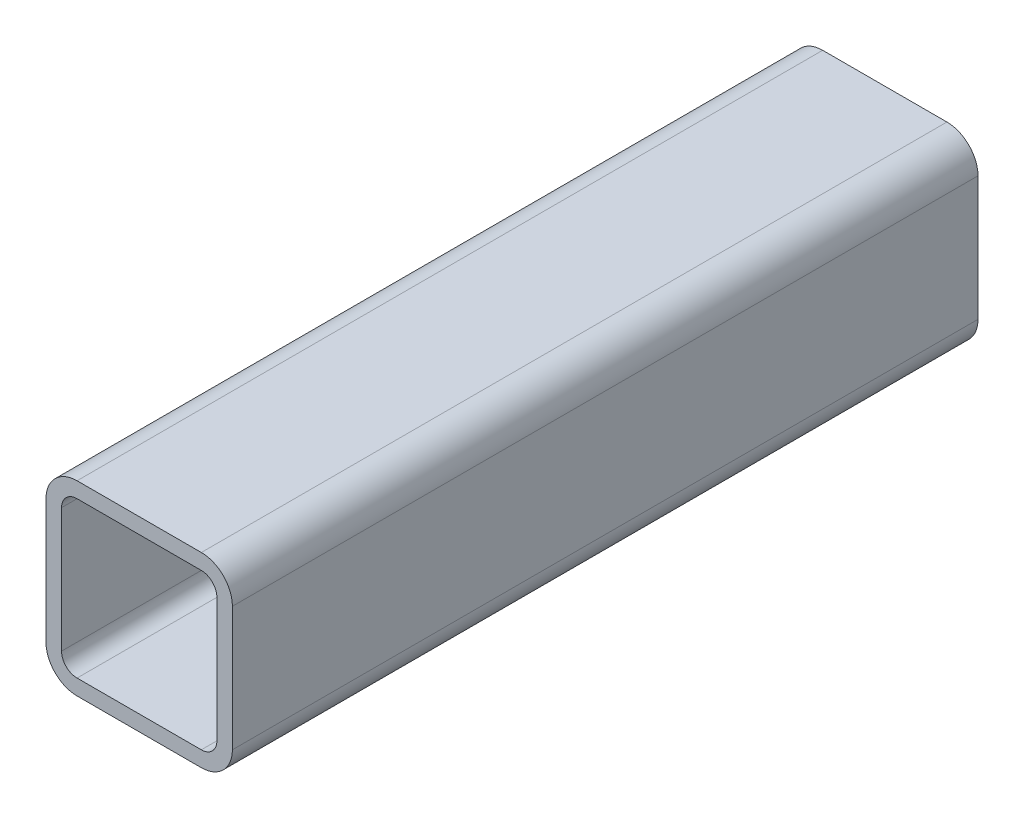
ISO-10303-21;
HEADER;
FILE_DESCRIPTION(('STEP AP214'),'2;1');
FILE_NAME('part.step','',(''),(''),'','','');
FILE_SCHEMA(('AUTOMOTIVE_DESIGN { 1 0 10303 214 1 1 1 1 }'));
ENDSEC;
DATA;
#1=APPLICATION_CONTEXT('core data for automotive mechanical design processes');
#2=APPLICATION_PROTOCOL_DEFINITION('international standard','automotive_design',2000,#1);
#3=PRODUCT_CONTEXT('',#1,'mechanical');
#4=PRODUCT('Part','Part','',(#3));
#5=PRODUCT_RELATED_PRODUCT_CATEGORY('part','',(#4));
#6=PRODUCT_DEFINITION_FORMATION('','',#4);
#7=PRODUCT_DEFINITION_CONTEXT('part definition',#1,'design');
#8=PRODUCT_DEFINITION('design','',#6,#7);
#9=PRODUCT_DEFINITION_SHAPE('','',#8);
#10=(LENGTH_UNIT() NAMED_UNIT(*) SI_UNIT(.MILLI.,.METRE.));
#11=(NAMED_UNIT(*) PLANE_ANGLE_UNIT() SI_UNIT($,.RADIAN.));
#12=(NAMED_UNIT(*) SI_UNIT($,.STERADIAN.) SOLID_ANGLE_UNIT());
#13=UNCERTAINTY_MEASURE_WITH_UNIT(LENGTH_MEASURE(1.E-05),#10,'distance_accuracy_value','');
#14=(GEOMETRIC_REPRESENTATION_CONTEXT(3) GLOBAL_UNCERTAINTY_ASSIGNED_CONTEXT((#13)) GLOBAL_UNIT_ASSIGNED_CONTEXT((#10,
#11,#12)) REPRESENTATION_CONTEXT('',''));
#15=CARTESIAN_POINT('',(0.,0.,0.));
#16=DIRECTION('',(0.,0.,1.));
#17=DIRECTION('',(1.,0.,0.));
#18=AXIS2_PLACEMENT_3D('',#15,#16,#17);
#19=CARTESIAN_POINT('',(15.1891160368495,65.5806737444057,304.8));
#20=DIRECTION('',(0.,0.,1.));
#21=DIRECTION('',(1.,0.,0.));
#22=AXIS2_PLACEMENT_3D('',#19,#20,#21);
#23=PLANE('',#22);
#24=CARTESIAN_POINT('',(15.1891160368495,65.5806737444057,304.8));
#25=DIRECTION('',(0.,0.,1.));
#26=DIRECTION('',(1.,0.,0.));
#27=AXIS2_PLACEMENT_3D('',#24,#25,#26);
#28=CIRCLE('',#27,12.7);
#29=CARTESIAN_POINT('',(15.1891160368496,78.2806737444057,304.8));
#30=VERTEX_POINT('',#29);
#31=CARTESIAN_POINT('',(2.48911603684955,65.5806737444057,304.8));
#32=VERTEX_POINT('',#31);
#33=EDGE_CURVE('E211',#30,#32,#28,.T.);
#34=ORIENTED_EDGE('',*,*,#33,.T.);
#35=DIRECTION('',(0.,-1.,0.));
#36=VECTOR('',#35,1.);
#37=CARTESIAN_POINT('',(2.48911603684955,14.7806737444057,304.8));
#38=LINE('',#37,#36);
#39=CARTESIAN_POINT('',(2.48911603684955,14.7806737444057,304.8));
#40=VERTEX_POINT('',#39);
#41=EDGE_CURVE('E214',#32,#40,#38,.T.);
#42=ORIENTED_EDGE('',*,*,#41,.T.);
#43=CARTESIAN_POINT('',(15.1891160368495,14.7806737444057,304.8));
#44=DIRECTION('',(0.,0.,1.));
#45=DIRECTION('',(1.,0.,0.));
#46=AXIS2_PLACEMENT_3D('',#43,#44,#45);
#47=CIRCLE('',#46,12.7);
#48=CARTESIAN_POINT('',(15.1891160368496,2.0806737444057,304.8));
#49=VERTEX_POINT('',#48);
#50=EDGE_CURVE('E217',#40,#49,#47,.T.);
#51=ORIENTED_EDGE('',*,*,#50,.T.);
#52=DIRECTION('',(1.,0.,0.));
#53=VECTOR('',#52,1.);
#54=CARTESIAN_POINT('',(65.9891160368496,2.0806737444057,304.8));
#55=LINE('',#54,#53);
#56=CARTESIAN_POINT('',(65.9891160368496,2.08067374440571,304.8));
#57=VERTEX_POINT('',#56);
#58=EDGE_CURVE('E219',#49,#57,#55,.T.);
#59=ORIENTED_EDGE('',*,*,#58,.T.);
#60=CARTESIAN_POINT('',(65.9891160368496,14.7806737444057,304.8));
#61=DIRECTION('',(0.,0.,1.));
#62=DIRECTION('',(1.,0.,0.));
#63=AXIS2_PLACEMENT_3D('',#60,#61,#62);
#64=CIRCLE('',#63,12.7);
#65=CARTESIAN_POINT('',(78.6891160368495,14.7806737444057,304.8));
#66=VERTEX_POINT('',#65);
#67=EDGE_CURVE('E221',#57,#66,#64,.T.);
#68=ORIENTED_EDGE('',*,*,#67,.T.);
#69=DIRECTION('',(0.,1.,0.));
#70=VECTOR('',#69,1.);
#71=CARTESIAN_POINT('',(78.6891160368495,65.5806737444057,304.8));
#72=LINE('',#71,#70);
#73=CARTESIAN_POINT('',(78.6891160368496,65.5806737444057,304.8));
#74=VERTEX_POINT('',#73);
#75=EDGE_CURVE('E223',#66,#74,#72,.T.);
#76=ORIENTED_EDGE('',*,*,#75,.T.);
#77=CARTESIAN_POINT('',(65.9891160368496,65.5806737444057,304.8));
#78=DIRECTION('',(0.,0.,1.));
#79=DIRECTION('',(1.,0.,0.));
#80=AXIS2_PLACEMENT_3D('',#77,#78,#79);
#81=CIRCLE('',#80,12.7);
#82=CARTESIAN_POINT('',(65.9891160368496,78.2806737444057,304.8));
#83=VERTEX_POINT('',#82);
#84=EDGE_CURVE('E225',#74,#83,#81,.T.);
#85=ORIENTED_EDGE('',*,*,#84,.T.);
#86=DIRECTION('',(-1.,0.,0.));
#87=VECTOR('',#86,1.);
#88=CARTESIAN_POINT('',(15.1891160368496,78.2806737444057,304.8));
#89=LINE('',#88,#87);
#90=EDGE_CURVE('E227',#83,#30,#89,.T.);
#91=ORIENTED_EDGE('',*,*,#90,.T.);
#92=EDGE_LOOP('',(#34,#42,#51,#59,#68,#76,#85,#91));
#93=FACE_BOUND('',#92,.T.);
#94=DIRECTION('',(0.,-1.,0.));
#95=VECTOR('',#94,1.);
#96=CARTESIAN_POINT('',(8.83911603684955,14.7806737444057,304.8));
#97=LINE('',#96,#95);
#98=CARTESIAN_POINT('',(8.83911603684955,65.5806737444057,304.8));
#99=VERTEX_POINT('',#98);
#100=CARTESIAN_POINT('',(8.83911603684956,14.7806737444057,304.8));
#101=VERTEX_POINT('',#100);
#102=EDGE_CURVE('E154',#99,#101,#97,.T.);
#103=ORIENTED_EDGE('',*,*,#102,.F.);
#104=CARTESIAN_POINT('',(15.1891160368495,65.5806737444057,304.8));
#105=DIRECTION('',(0.,0.,1.));
#106=DIRECTION('',(1.,0.,0.));
#107=AXIS2_PLACEMENT_3D('',#104,#105,#106);
#108=CIRCLE('',#107,6.35);
#109=CARTESIAN_POINT('',(15.1891160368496,71.9306737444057,304.8));
#110=VERTEX_POINT('',#109);
#111=EDGE_CURVE('E146',#110,#99,#108,.T.);
#112=ORIENTED_EDGE('',*,*,#111,.F.);
#113=DIRECTION('',(-1.,0.,0.));
#114=VECTOR('',#113,1.);
#115=CARTESIAN_POINT('',(15.1891160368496,71.9306737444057,304.8));
#116=LINE('',#115,#114);
#117=CARTESIAN_POINT('',(65.9891160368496,71.9306737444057,304.8));
#118=VERTEX_POINT('',#117);
#119=EDGE_CURVE('E179',#118,#110,#116,.T.);
#120=ORIENTED_EDGE('',*,*,#119,.F.);
#121=CARTESIAN_POINT('',(65.9891160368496,65.5806737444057,304.8));
#122=DIRECTION('',(0.,0.,1.));
#123=DIRECTION('',(1.,0.,0.));
#124=AXIS2_PLACEMENT_3D('',#121,#122,#123);
#125=CIRCLE('',#124,6.35);
#126=CARTESIAN_POINT('',(72.3391160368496,65.5806737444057,304.8));
#127=VERTEX_POINT('',#126);
#128=EDGE_CURVE('E177',#127,#118,#125,.T.);
#129=ORIENTED_EDGE('',*,*,#128,.F.);
#130=DIRECTION('',(0.,1.,0.));
#131=VECTOR('',#130,1.);
#132=CARTESIAN_POINT('',(72.3391160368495,65.5806737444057,304.8));
#133=LINE('',#132,#131);
#134=CARTESIAN_POINT('',(72.3391160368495,14.7806737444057,304.8));
#135=VERTEX_POINT('',#134);
#136=EDGE_CURVE('E175',#135,#127,#133,.T.);
#137=ORIENTED_EDGE('',*,*,#136,.F.);
#138=CARTESIAN_POINT('',(65.9891160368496,14.7806737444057,304.8));
#139=DIRECTION('',(0.,0.,1.));
#140=DIRECTION('',(1.,0.,0.));
#141=AXIS2_PLACEMENT_3D('',#138,#139,#140);
#142=CIRCLE('',#141,6.34999999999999);
#143=CARTESIAN_POINT('',(65.9891160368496,8.43067374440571,304.8));
#144=VERTEX_POINT('',#143);
#145=EDGE_CURVE('E173',#144,#135,#142,.T.);
#146=ORIENTED_EDGE('',*,*,#145,.F.);
#147=DIRECTION('',(1.,0.,0.));
#148=VECTOR('',#147,1.);
#149=CARTESIAN_POINT('',(65.9891160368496,8.4306737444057,304.8));
#150=LINE('',#149,#148);
#151=CARTESIAN_POINT('',(15.1891160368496,8.4306737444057,304.8));
#152=VERTEX_POINT('',#151);
#153=EDGE_CURVE('E169',#152,#144,#150,.T.);
#154=ORIENTED_EDGE('',*,*,#153,.F.);
#155=CARTESIAN_POINT('',(15.1891160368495,14.7806737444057,304.8));
#156=DIRECTION('',(0.,0.,1.));
#157=DIRECTION('',(1.,0.,0.));
#158=AXIS2_PLACEMENT_3D('',#155,#156,#157);
#159=CIRCLE('',#158,6.34999999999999);
#160=EDGE_CURVE('E167',#101,#152,#159,.T.);
#161=ORIENTED_EDGE('',*,*,#160,.F.);
#162=EDGE_LOOP('',(#103,#112,#120,#129,#137,#146,#154,#161));
#163=FACE_BOUND('',#162,.T.);
#164=ADVANCED_FACE('F33',(#93,#163),#23,.T.);
#165=CARTESIAN_POINT('',(15.1891160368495,65.5806737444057,0.));
#166=DIRECTION('',(0.,0.,1.));
#167=DIRECTION('',(1.,0.,0.));
#168=AXIS2_PLACEMENT_3D('',#165,#166,#167);
#169=PLANE('',#168);
#170=CARTESIAN_POINT('',(15.1891160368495,65.5806737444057,0.));
#171=DIRECTION('',(0.,0.,1.));
#172=DIRECTION('',(1.,0.,0.));
#173=AXIS2_PLACEMENT_3D('',#170,#171,#172);
#174=CIRCLE('',#173,12.7);
#175=CARTESIAN_POINT('',(15.1891160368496,78.2806737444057,0.));
#176=VERTEX_POINT('',#175);
#177=CARTESIAN_POINT('',(2.48911603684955,65.5806737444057,0.));
#178=VERTEX_POINT('',#177);
#179=EDGE_CURVE('E162',#176,#178,#174,.T.);
#180=ORIENTED_EDGE('',*,*,#179,.F.);
#181=DIRECTION('',(-1.,0.,0.));
#182=VECTOR('',#181,1.);
#183=CARTESIAN_POINT('',(15.1891160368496,78.2806737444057,0.));
#184=LINE('',#183,#182);
#185=CARTESIAN_POINT('',(65.9891160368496,78.2806737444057,0.));
#186=VERTEX_POINT('',#185);
#187=EDGE_CURVE('E215',#186,#176,#184,.T.);
#188=ORIENTED_EDGE('',*,*,#187,.F.);
#189=CARTESIAN_POINT('',(65.9891160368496,65.5806737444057,0.));
#190=DIRECTION('',(0.,0.,1.));
#191=DIRECTION('',(1.,0.,0.));
#192=AXIS2_PLACEMENT_3D('',#189,#190,#191);
#193=CIRCLE('',#192,12.7);
#194=CARTESIAN_POINT('',(78.6891160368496,65.5806737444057,0.));
#195=VERTEX_POINT('',#194);
#196=EDGE_CURVE('E242',#195,#186,#193,.T.);
#197=ORIENTED_EDGE('',*,*,#196,.F.);
#198=DIRECTION('',(0.,1.,0.));
#199=VECTOR('',#198,1.);
#200=CARTESIAN_POINT('',(78.6891160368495,65.5806737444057,0.));
#201=LINE('',#200,#199);
#202=CARTESIAN_POINT('',(78.6891160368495,14.7806737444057,0.));
#203=VERTEX_POINT('',#202);
#204=EDGE_CURVE('E240',#203,#195,#201,.T.);
#205=ORIENTED_EDGE('',*,*,#204,.F.);
#206=CARTESIAN_POINT('',(65.9891160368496,14.7806737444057,0.));
#207=DIRECTION('',(0.,0.,1.));
#208=DIRECTION('',(1.,0.,0.));
#209=AXIS2_PLACEMENT_3D('',#206,#207,#208);
#210=CIRCLE('',#209,12.7);
#211=CARTESIAN_POINT('',(65.9891160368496,2.08067374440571,0.));
#212=VERTEX_POINT('',#211);
#213=EDGE_CURVE('E238',#212,#203,#210,.T.);
#214=ORIENTED_EDGE('',*,*,#213,.F.);
#215=DIRECTION('',(1.,0.,0.));
#216=VECTOR('',#215,1.);
#217=CARTESIAN_POINT('',(65.9891160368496,2.0806737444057,0.));
#218=LINE('',#217,#216);
#219=CARTESIAN_POINT('',(15.1891160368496,2.0806737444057,0.));
#220=VERTEX_POINT('',#219);
#221=EDGE_CURVE('E236',#220,#212,#218,.T.);
#222=ORIENTED_EDGE('',*,*,#221,.F.);
#223=CARTESIAN_POINT('',(15.1891160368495,14.7806737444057,0.));
#224=DIRECTION('',(0.,0.,1.));
#225=DIRECTION('',(1.,0.,0.));
#226=AXIS2_PLACEMENT_3D('',#223,#224,#225);
#227=CIRCLE('',#226,12.7);
#228=CARTESIAN_POINT('',(2.48911603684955,14.7806737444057,0.));
#229=VERTEX_POINT('',#228);
#230=EDGE_CURVE('E234',#229,#220,#227,.T.);
#231=ORIENTED_EDGE('',*,*,#230,.F.);
#232=DIRECTION('',(0.,-1.,0.));
#233=VECTOR('',#232,1.);
#234=CARTESIAN_POINT('',(2.48911603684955,14.7806737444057,0.));
#235=LINE('',#234,#233);
#236=EDGE_CURVE('E232',#178,#229,#235,.T.);
#237=ORIENTED_EDGE('',*,*,#236,.F.);
#238=EDGE_LOOP('',(#180,#188,#197,#205,#214,#222,#231,#237));
#239=FACE_BOUND('',#238,.T.);
#240=CARTESIAN_POINT('',(15.1891160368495,65.5806737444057,0.));
#241=DIRECTION('',(0.,0.,1.));
#242=DIRECTION('',(1.,0.,0.));
#243=AXIS2_PLACEMENT_3D('',#240,#241,#242);
#244=CIRCLE('',#243,6.35);
#245=CARTESIAN_POINT('',(15.1891160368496,71.9306737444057,0.));
#246=VERTEX_POINT('',#245);
#247=CARTESIAN_POINT('',(8.83911603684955,65.5806737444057,0.));
#248=VERTEX_POINT('',#247);
#249=EDGE_CURVE('E56',#246,#248,#244,.T.);
#250=ORIENTED_EDGE('',*,*,#249,.T.);
#251=DIRECTION('',(0.,-1.,0.));
#252=VECTOR('',#251,1.);
#253=CARTESIAN_POINT('',(8.83911603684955,14.7806737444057,0.));
#254=LINE('',#253,#252);
#255=CARTESIAN_POINT('',(8.83911603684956,14.7806737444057,0.));
#256=VERTEX_POINT('',#255);
#257=EDGE_CURVE('E161',#248,#256,#254,.T.);
#258=ORIENTED_EDGE('',*,*,#257,.T.);
#259=CARTESIAN_POINT('',(15.1891160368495,14.7806737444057,0.));
#260=DIRECTION('',(0.,0.,1.));
#261=DIRECTION('',(1.,0.,0.));
#262=AXIS2_PLACEMENT_3D('',#259,#260,#261);
#263=CIRCLE('',#262,6.34999999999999);
#264=CARTESIAN_POINT('',(15.1891160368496,8.4306737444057,0.));
#265=VERTEX_POINT('',#264);
#266=EDGE_CURVE('E183',#256,#265,#263,.T.);
#267=ORIENTED_EDGE('',*,*,#266,.T.);
#268=DIRECTION('',(1.,0.,0.));
#269=VECTOR('',#268,1.);
#270=CARTESIAN_POINT('',(65.9891160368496,8.4306737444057,0.));
#271=LINE('',#270,#269);
#272=CARTESIAN_POINT('',(65.9891160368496,8.43067374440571,0.));
#273=VERTEX_POINT('',#272);
#274=EDGE_CURVE('E186',#265,#273,#271,.T.);
#275=ORIENTED_EDGE('',*,*,#274,.T.);
#276=CARTESIAN_POINT('',(65.9891160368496,14.7806737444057,0.));
#277=DIRECTION('',(0.,0.,1.));
#278=DIRECTION('',(1.,0.,0.));
#279=AXIS2_PLACEMENT_3D('',#276,#277,#278);
#280=CIRCLE('',#279,6.34999999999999);
#281=CARTESIAN_POINT('',(72.3391160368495,14.7806737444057,0.));
#282=VERTEX_POINT('',#281);
#283=EDGE_CURVE('E189',#273,#282,#280,.T.);
#284=ORIENTED_EDGE('',*,*,#283,.T.);
#285=DIRECTION('',(0.,1.,0.));
#286=VECTOR('',#285,1.);
#287=CARTESIAN_POINT('',(72.3391160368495,65.5806737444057,0.));
#288=LINE('',#287,#286);
#289=CARTESIAN_POINT('',(72.3391160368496,65.5806737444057,0.));
#290=VERTEX_POINT('',#289);
#291=EDGE_CURVE('E192',#282,#290,#288,.T.);
#292=ORIENTED_EDGE('',*,*,#291,.T.);
#293=CARTESIAN_POINT('',(65.9891160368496,65.5806737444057,0.));
#294=DIRECTION('',(0.,0.,1.));
#295=DIRECTION('',(1.,0.,0.));
#296=AXIS2_PLACEMENT_3D('',#293,#294,#295);
#297=CIRCLE('',#296,6.35);
#298=CARTESIAN_POINT('',(65.9891160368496,71.9306737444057,0.));
#299=VERTEX_POINT('',#298);
#300=EDGE_CURVE('E195',#290,#299,#297,.T.);
#301=ORIENTED_EDGE('',*,*,#300,.T.);
#302=DIRECTION('',(-1.,0.,0.));
#303=VECTOR('',#302,1.);
#304=CARTESIAN_POINT('',(15.1891160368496,71.9306737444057,0.));
#305=LINE('',#304,#303);
#306=EDGE_CURVE('E155',#299,#246,#305,.T.);
#307=ORIENTED_EDGE('',*,*,#306,.T.);
#308=EDGE_LOOP('',(#250,#258,#267,#275,#284,#292,#301,#307));
#309=FACE_BOUND('',#308,.T.);
#310=ADVANCED_FACE('F272',(#239,#309),#169,.F.);
#311=CARTESIAN_POINT('',(15.1891160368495,65.5806737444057,304.8));
#312=DIRECTION('',(0.,0.,-1.));
#313=DIRECTION('',(-1.,0.,0.));
#314=AXIS2_PLACEMENT_3D('',#311,#312,#313);
#315=CYLINDRICAL_SURFACE('',#314,12.7);
#316=ORIENTED_EDGE('',*,*,#179,.T.);
#317=DIRECTION('',(0.,0.,-1.));
#318=VECTOR('',#317,1.);
#319=CARTESIAN_POINT('',(2.48911603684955,65.5806737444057,304.8));
#320=LINE('',#319,#318);
#321=EDGE_CURVE('E11',#32,#178,#320,.T.);
#322=ORIENTED_EDGE('',*,*,#321,.F.);
#323=ORIENTED_EDGE('',*,*,#33,.F.);
#324=DIRECTION('',(0.,0.,-1.));
#325=VECTOR('',#324,1.);
#326=CARTESIAN_POINT('',(15.1891160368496,78.2806737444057,304.8));
#327=LINE('',#326,#325);
#328=EDGE_CURVE('E229',#30,#176,#327,.T.);
#329=ORIENTED_EDGE('',*,*,#328,.T.);
#330=EDGE_LOOP('',(#316,#322,#323,#329));
#331=FACE_BOUND('',#330,.T.);
#332=ADVANCED_FACE('F35',(#331),#315,.T.);
#333=CARTESIAN_POINT('',(2.48911603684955,14.7806737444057,304.8));
#334=DIRECTION('',(1.,0.,0.));
#335=DIRECTION('',(0.,0.,-1.));
#336=AXIS2_PLACEMENT_3D('',#333,#334,#335);
#337=PLANE('',#336);
#338=ORIENTED_EDGE('',*,*,#236,.T.);
#339=DIRECTION('',(0.,0.,-1.));
#340=VECTOR('',#339,1.);
#341=CARTESIAN_POINT('',(2.48911603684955,14.7806737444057,304.8));
#342=LINE('',#341,#340);
#343=EDGE_CURVE('E41',#40,#229,#342,.T.);
#344=ORIENTED_EDGE('',*,*,#343,.F.);
#345=ORIENTED_EDGE('',*,*,#41,.F.);
#346=ORIENTED_EDGE('',*,*,#321,.T.);
#347=EDGE_LOOP('',(#338,#344,#345,#346));
#348=FACE_BOUND('',#347,.T.);
#349=ADVANCED_FACE('F289',(#348),#337,.F.);
#350=CARTESIAN_POINT('',(15.1891160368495,14.7806737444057,304.8));
#351=DIRECTION('',(0.,0.,-1.));
#352=DIRECTION('',(-1.,0.,0.));
#353=AXIS2_PLACEMENT_3D('',#350,#351,#352);
#354=CYLINDRICAL_SURFACE('',#353,12.7);
#355=ORIENTED_EDGE('',*,*,#230,.T.);
#356=DIRECTION('',(0.,0.,-1.));
#357=VECTOR('',#356,1.);
#358=CARTESIAN_POINT('',(15.1891160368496,2.0806737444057,304.8));
#359=LINE('',#358,#357);
#360=EDGE_CURVE('E259',#49,#220,#359,.T.);
#361=ORIENTED_EDGE('',*,*,#360,.F.);
#362=ORIENTED_EDGE('',*,*,#50,.F.);
#363=ORIENTED_EDGE('',*,*,#343,.T.);
#364=EDGE_LOOP('',(#355,#361,#362,#363));
#365=FACE_BOUND('',#364,.T.);
#366=ADVANCED_FACE('F266',(#365),#354,.T.);
#367=CARTESIAN_POINT('',(65.9891160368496,2.0806737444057,304.8));
#368=DIRECTION('',(0.,1.,0.));
#369=DIRECTION('',(0.,0.,1.));
#370=AXIS2_PLACEMENT_3D('',#367,#368,#369);
#371=PLANE('',#370);
#372=ORIENTED_EDGE('',*,*,#221,.T.);
#373=DIRECTION('',(0.,0.,-1.));
#374=VECTOR('',#373,1.);
#375=CARTESIAN_POINT('',(65.9891160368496,2.08067374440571,304.8));
#376=LINE('',#375,#374);
#377=EDGE_CURVE('E256',#57,#212,#376,.T.);
#378=ORIENTED_EDGE('',*,*,#377,.F.);
#379=ORIENTED_EDGE('',*,*,#58,.F.);
#380=ORIENTED_EDGE('',*,*,#360,.T.);
#381=EDGE_LOOP('',(#372,#378,#379,#380));
#382=FACE_BOUND('',#381,.T.);
#383=ADVANCED_FACE('F278',(#382),#371,.F.);
#384=CARTESIAN_POINT('',(65.9891160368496,14.7806737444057,304.8));
#385=DIRECTION('',(0.,0.,-1.));
#386=DIRECTION('',(-1.,0.,0.));
#387=AXIS2_PLACEMENT_3D('',#384,#385,#386);
#388=CYLINDRICAL_SURFACE('',#387,12.7);
#389=ORIENTED_EDGE('',*,*,#213,.T.);
#390=DIRECTION('',(0.,0.,-1.));
#391=VECTOR('',#390,1.);
#392=CARTESIAN_POINT('',(78.6891160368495,14.7806737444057,304.8));
#393=LINE('',#392,#391);
#394=EDGE_CURVE('E253',#66,#203,#393,.T.);
#395=ORIENTED_EDGE('',*,*,#394,.F.);
#396=ORIENTED_EDGE('',*,*,#67,.F.);
#397=ORIENTED_EDGE('',*,*,#377,.T.);
#398=EDGE_LOOP('',(#389,#395,#396,#397));
#399=FACE_BOUND('',#398,.T.);
#400=ADVANCED_FACE('F282',(#399),#388,.T.);
#401=CARTESIAN_POINT('',(78.6891160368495,65.5806737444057,304.8));
#402=DIRECTION('',(-1.,0.,0.));
#403=DIRECTION('',(0.,0.,1.));
#404=AXIS2_PLACEMENT_3D('',#401,#402,#403);
#405=PLANE('',#404);
#406=ORIENTED_EDGE('',*,*,#204,.T.);
#407=DIRECTION('',(0.,0.,-1.));
#408=VECTOR('',#407,1.);
#409=CARTESIAN_POINT('',(78.6891160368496,65.5806737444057,304.8));
#410=LINE('',#409,#408);
#411=EDGE_CURVE('E250',#74,#195,#410,.T.);
#412=ORIENTED_EDGE('',*,*,#411,.F.);
#413=ORIENTED_EDGE('',*,*,#75,.F.);
#414=ORIENTED_EDGE('',*,*,#394,.T.);
#415=EDGE_LOOP('',(#406,#412,#413,#414));
#416=FACE_BOUND('',#415,.T.);
#417=ADVANCED_FACE('F302',(#416),#405,.F.);
#418=CARTESIAN_POINT('',(65.9891160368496,65.5806737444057,304.8));
#419=DIRECTION('',(0.,0.,-1.));
#420=DIRECTION('',(-1.,0.,0.));
#421=AXIS2_PLACEMENT_3D('',#418,#419,#420);
#422=CYLINDRICAL_SURFACE('',#421,12.7);
#423=ORIENTED_EDGE('',*,*,#196,.T.);
#424=DIRECTION('',(0.,0.,-1.));
#425=VECTOR('',#424,1.);
#426=CARTESIAN_POINT('',(65.9891160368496,78.2806737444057,304.8));
#427=LINE('',#426,#425);
#428=EDGE_CURVE('E247',#83,#186,#427,.T.);
#429=ORIENTED_EDGE('',*,*,#428,.F.);
#430=ORIENTED_EDGE('',*,*,#84,.F.);
#431=ORIENTED_EDGE('',*,*,#411,.T.);
#432=EDGE_LOOP('',(#423,#429,#430,#431));
#433=FACE_BOUND('',#432,.T.);
#434=ADVANCED_FACE('F300',(#433),#422,.T.);
#435=CARTESIAN_POINT('',(15.1891160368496,78.2806737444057,304.8));
#436=DIRECTION('',(0.,-1.,0.));
#437=DIRECTION('',(0.,0.,-1.));
#438=AXIS2_PLACEMENT_3D('',#435,#436,#437);
#439=PLANE('',#438);
#440=ORIENTED_EDGE('',*,*,#187,.T.);
#441=ORIENTED_EDGE('',*,*,#328,.F.);
#442=ORIENTED_EDGE('',*,*,#90,.F.);
#443=ORIENTED_EDGE('',*,*,#428,.T.);
#444=EDGE_LOOP('',(#440,#441,#442,#443));
#445=FACE_BOUND('',#444,.T.);
#446=ADVANCED_FACE('F295',(#445),#439,.F.);
#447=CARTESIAN_POINT('',(15.1891160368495,65.5806737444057,304.8));
#448=DIRECTION('',(0.,0.,-1.));
#449=DIRECTION('',(-1.,0.,0.));
#450=AXIS2_PLACEMENT_3D('',#447,#448,#449);
#451=CYLINDRICAL_SURFACE('',#450,6.35);
#452=ORIENTED_EDGE('',*,*,#249,.F.);
#453=DIRECTION('',(0.,0.,-1.));
#454=VECTOR('',#453,1.);
#455=CARTESIAN_POINT('',(15.1891160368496,71.9306737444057,304.8));
#456=LINE('',#455,#454);
#457=EDGE_CURVE('E150',#110,#246,#456,.T.);
#458=ORIENTED_EDGE('',*,*,#457,.F.);
#459=ORIENTED_EDGE('',*,*,#111,.T.);
#460=DIRECTION('',(0.,0.,-1.));
#461=VECTOR('',#460,1.);
#462=CARTESIAN_POINT('',(8.83911603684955,65.5806737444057,304.8));
#463=LINE('',#462,#461);
#464=EDGE_CURVE('E149',#99,#248,#463,.T.);
#465=ORIENTED_EDGE('',*,*,#464,.T.);
#466=EDGE_LOOP('',(#452,#458,#459,#465));
#467=FACE_BOUND('',#466,.T.);
#468=ADVANCED_FACE('F148',(#467),#451,.F.);
#469=CARTESIAN_POINT('',(8.83911603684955,14.7806737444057,304.8));
#470=DIRECTION('',(1.,0.,0.));
#471=DIRECTION('',(0.,0.,-1.));
#472=AXIS2_PLACEMENT_3D('',#469,#470,#471);
#473=PLANE('',#472);
#474=ORIENTED_EDGE('',*,*,#257,.F.);
#475=ORIENTED_EDGE('',*,*,#464,.F.);
#476=ORIENTED_EDGE('',*,*,#102,.T.);
#477=DIRECTION('',(0.,0.,-1.));
#478=VECTOR('',#477,1.);
#479=CARTESIAN_POINT('',(8.83911603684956,14.7806737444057,304.8));
#480=LINE('',#479,#478);
#481=EDGE_CURVE('E163',#101,#256,#480,.T.);
#482=ORIENTED_EDGE('',*,*,#481,.T.);
#483=EDGE_LOOP('',(#474,#475,#476,#482));
#484=FACE_BOUND('',#483,.T.);
#485=ADVANCED_FACE('F158',(#484),#473,.T.);
#486=CARTESIAN_POINT('',(15.1891160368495,14.7806737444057,304.8));
#487=DIRECTION('',(0.,0.,-1.));
#488=DIRECTION('',(-1.,0.,0.));
#489=AXIS2_PLACEMENT_3D('',#486,#487,#488);
#490=CYLINDRICAL_SURFACE('',#489,6.34999999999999);
#491=ORIENTED_EDGE('',*,*,#266,.F.);
#492=ORIENTED_EDGE('',*,*,#481,.F.);
#493=ORIENTED_EDGE('',*,*,#160,.T.);
#494=DIRECTION('',(0.,0.,-1.));
#495=VECTOR('',#494,1.);
#496=CARTESIAN_POINT('',(15.1891160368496,8.4306737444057,304.8));
#497=LINE('',#496,#495);
#498=EDGE_CURVE('E208',#152,#265,#497,.T.);
#499=ORIENTED_EDGE('',*,*,#498,.T.);
#500=EDGE_LOOP('',(#491,#492,#493,#499));
#501=FACE_BOUND('',#500,.T.);
#502=ADVANCED_FACE('F327',(#501),#490,.F.);
#503=CARTESIAN_POINT('',(65.9891160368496,8.4306737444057,304.8));
#504=DIRECTION('',(0.,1.,0.));
#505=DIRECTION('',(0.,0.,1.));
#506=AXIS2_PLACEMENT_3D('',#503,#504,#505);
#507=PLANE('',#506);
#508=ORIENTED_EDGE('',*,*,#274,.F.);
#509=ORIENTED_EDGE('',*,*,#498,.F.);
#510=ORIENTED_EDGE('',*,*,#153,.T.);
#511=DIRECTION('',(0.,0.,-1.));
#512=VECTOR('',#511,1.);
#513=CARTESIAN_POINT('',(65.9891160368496,8.43067374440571,304.8));
#514=LINE('',#513,#512);
#515=EDGE_CURVE('E206',#144,#273,#514,.T.);
#516=ORIENTED_EDGE('',*,*,#515,.T.);
#517=EDGE_LOOP('',(#508,#509,#510,#516));
#518=FACE_BOUND('',#517,.T.);
#519=ADVANCED_FACE('F331',(#518),#507,.T.);
#520=CARTESIAN_POINT('',(65.9891160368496,14.7806737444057,304.8));
#521=DIRECTION('',(0.,0.,-1.));
#522=DIRECTION('',(-1.,0.,0.));
#523=AXIS2_PLACEMENT_3D('',#520,#521,#522);
#524=CYLINDRICAL_SURFACE('',#523,6.34999999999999);
#525=ORIENTED_EDGE('',*,*,#283,.F.);
#526=ORIENTED_EDGE('',*,*,#515,.F.);
#527=ORIENTED_EDGE('',*,*,#145,.T.);
#528=DIRECTION('',(0.,0.,-1.));
#529=VECTOR('',#528,1.);
#530=CARTESIAN_POINT('',(72.3391160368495,14.7806737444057,304.8));
#531=LINE('',#530,#529);
#532=EDGE_CURVE('E204',#135,#282,#531,.T.);
#533=ORIENTED_EDGE('',*,*,#532,.T.);
#534=EDGE_LOOP('',(#525,#526,#527,#533));
#535=FACE_BOUND('',#534,.T.);
#536=ADVANCED_FACE('F337',(#535),#524,.F.);
#537=CARTESIAN_POINT('',(72.3391160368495,65.5806737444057,304.8));
#538=DIRECTION('',(-1.,0.,0.));
#539=DIRECTION('',(0.,0.,1.));
#540=AXIS2_PLACEMENT_3D('',#537,#538,#539);
#541=PLANE('',#540);
#542=ORIENTED_EDGE('',*,*,#291,.F.);
#543=ORIENTED_EDGE('',*,*,#532,.F.);
#544=ORIENTED_EDGE('',*,*,#136,.T.);
#545=DIRECTION('',(0.,0.,-1.));
#546=VECTOR('',#545,1.);
#547=CARTESIAN_POINT('',(72.3391160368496,65.5806737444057,304.8));
#548=LINE('',#547,#546);
#549=EDGE_CURVE('E202',#127,#290,#548,.T.);
#550=ORIENTED_EDGE('',*,*,#549,.T.);
#551=EDGE_LOOP('',(#542,#543,#544,#550));
#552=FACE_BOUND('',#551,.T.);
#553=ADVANCED_FACE('F341',(#552),#541,.T.);
#554=CARTESIAN_POINT('',(65.9891160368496,65.5806737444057,304.8));
#555=DIRECTION('',(0.,0.,-1.));
#556=DIRECTION('',(-1.,0.,0.));
#557=AXIS2_PLACEMENT_3D('',#554,#555,#556);
#558=CYLINDRICAL_SURFACE('',#557,6.35);
#559=ORIENTED_EDGE('',*,*,#300,.F.);
#560=ORIENTED_EDGE('',*,*,#549,.F.);
#561=ORIENTED_EDGE('',*,*,#128,.T.);
#562=DIRECTION('',(0.,0.,-1.));
#563=VECTOR('',#562,1.);
#564=CARTESIAN_POINT('',(65.9891160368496,71.9306737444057,304.8));
#565=LINE('',#564,#563);
#566=EDGE_CURVE('E48',#118,#299,#565,.T.);
#567=ORIENTED_EDGE('',*,*,#566,.T.);
#568=EDGE_LOOP('',(#559,#560,#561,#567));
#569=FACE_BOUND('',#568,.T.);
#570=ADVANCED_FACE('F345',(#569),#558,.F.);
#571=CARTESIAN_POINT('',(15.1891160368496,71.9306737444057,304.8));
#572=DIRECTION('',(0.,-1.,0.));
#573=DIRECTION('',(0.,0.,-1.));
#574=AXIS2_PLACEMENT_3D('',#571,#572,#573);
#575=PLANE('',#574);
#576=ORIENTED_EDGE('',*,*,#306,.F.);
#577=ORIENTED_EDGE('',*,*,#566,.F.);
#578=ORIENTED_EDGE('',*,*,#119,.T.);
#579=ORIENTED_EDGE('',*,*,#457,.T.);
#580=EDGE_LOOP('',(#576,#577,#578,#579));
#581=FACE_BOUND('',#580,.T.);
#582=ADVANCED_FACE('F349',(#581),#575,.T.);
#583=CLOSED_SHELL('',(#164,#310,#332,#349,#366,#383,#400,#417,#434,#446,#468,#485,#502,#519,
#536,#553,#570,#582));
#584=MANIFOLD_SOLID_BREP('B2',#583);
#585=ADVANCED_BREP_SHAPE_REPRESENTATION('',(#18,#584),#14);
#586=SHAPE_DEFINITION_REPRESENTATION(#9,#585);
ENDSEC;
END-ISO-10303-21;
